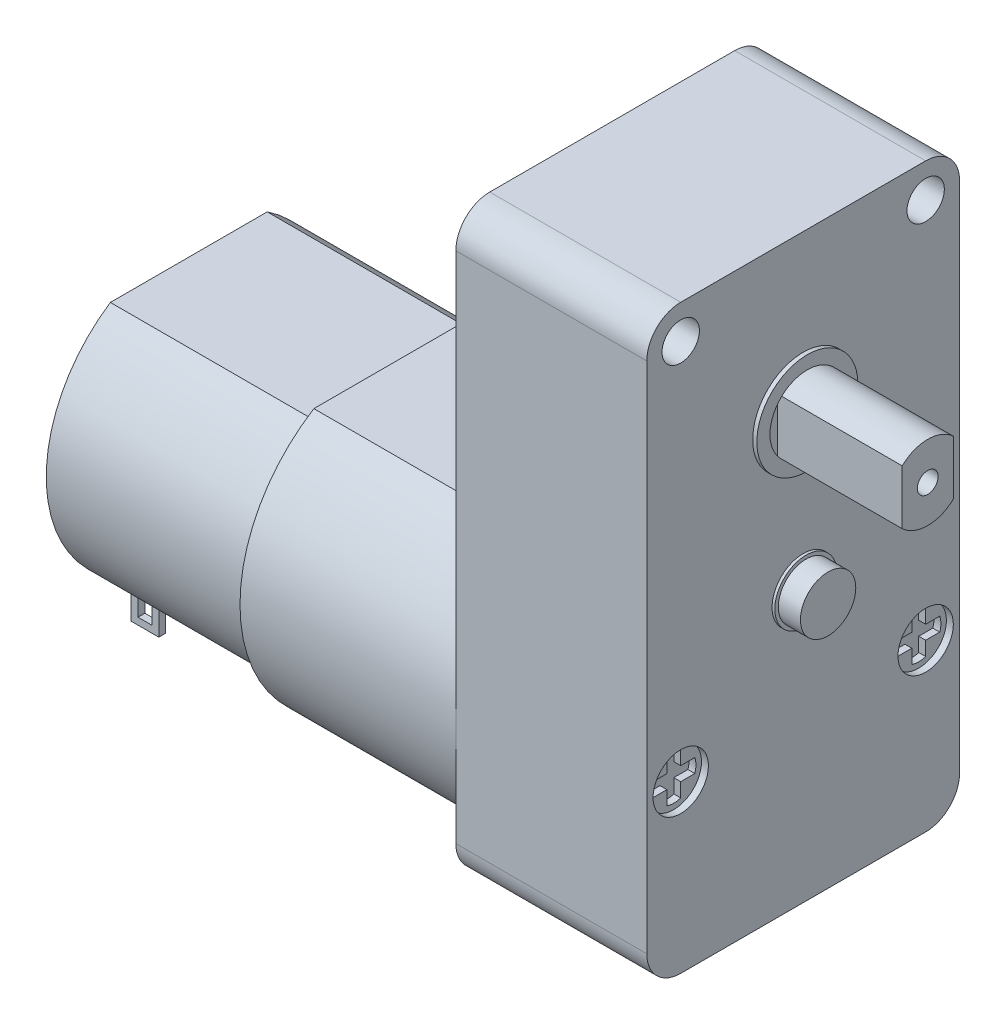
from build123d import *

# Parameters (mm, degrees)
BOSS_EXTRUDE1_DEPTH  = 13.8
SKETCH2_R            = 1.35
CUT_EXTRUDE1_DEPTH   = 13.8
SKETCH3_R            = 2
BOSS_EXTRUDE2_DEPTH  = 1.8
SKETCH4_R            = 2.25
BOSS_EXTRUDE3_DEPTH  = 0.2
SKETCH5_R            = 2.7
BOSS_EXTRUDE4_DEPTH  = 9
SKETCH6_W            = 3.099909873
SKETCH6_H            = 6.147728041
CUT_EXTRUDE2_DEPTH   = 9
SKETCH7_R            = 0.75
CUT_EXTRUDE3_DEPTH   = 2
SKETCH8_R            = 3.65
SKETCH8_R_2          = 2.7
BOSS_EXTRUDE5_DEPTH  = 0.3
SKETCH9_R            = 2
CUT_EXTRUDE4_DEPTH   = 0.5
CUT_EXTRUDE5_DEPTH   = 0.5
BOSS_EXTRUDE6_DEPTH  = 15.6
BOSS_EXTRUDE7_DEPTH  = 15
SKETCH15_R           = 4
BOSS_EXTRUDE8_DEPTH  = 1
SKETCH16_R           = 1
BOSS_EXTRUDE9_DEPTH  = 1
SKETCH17_W           = 2
SKETCH17_H           = 0.5
BOSS_EXTRUDE10_DEPTH = 3
SKETCH18_W           = 1
SKETCH18_H           = 2
CUT_EXTRUDE6_DEPTH   = 13


with BuildPart() as part:
    # Sketch1 → Boss-Extrude1 (new body)
    with BuildSketch(Plane(origin=(0, 0, 0), x_dir=(0, 0, -1), z_dir=(1, 0, 0))):
        with BuildLine():
            Line((2.45, 0), (20.15, 0))
            ThreePointArc((20.15, 0), (21.882411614, 0.717588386), (22.6, 2.45))
            Line((22.6, 2.45), (22.6, 39.55))
            ThreePointArc((22.6, 39.55), (21.882411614, 41.282411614), (20.15, 42))
            Line((20.15, 42), (2.45, 42))
            ThreePointArc((2.45, 42), (0.717588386, 41.282411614), (0, 39.55))
            Line((0, 39.55), (0, 2.45))
            ThreePointArc((0, 2.45), (0.717588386, 0.717588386), (2.45, 0))
        make_face()
    extrude(amount=BOSS_EXTRUDE1_DEPTH)

    # Sketch2 → Cut-Extrude1 (cut)
    with BuildSketch(Plane(origin=(13.8, 0, 0), x_dir=(0, 0, -1), z_dir=(1, 0, 0))):
        with Locations((2.45, 39.55)):
            Circle(SKETCH2_R)
        with Locations((20.15, 39.55)):
            Circle(SKETCH2_R)
    extrude(amount=-CUT_EXTRUDE1_DEPTH, mode=Mode.SUBTRACT)

    # Sketch3 → Boss-Extrude2 (add)
    with BuildSketch(Plane(origin=(13.8, 0, 0), x_dir=(0, 0, -1), z_dir=(1, 0, 0))):
        with Locations((11.3, 19.6)):
            Circle(SKETCH3_R)
    extrude(amount=BOSS_EXTRUDE2_DEPTH)

    # Sketch4 → Boss-Extrude3 (add)
    with BuildSketch(Plane(origin=(13.8, 0, 0), x_dir=(0, 0, -1), z_dir=(1, 0, 0))):
        with Locations((11.3, 19.6)):
            Circle(SKETCH4_R)
    extrude(amount=BOSS_EXTRUDE3_DEPTH)

    # Sketch5 → Boss-Extrude4 (add)
    with BuildSketch(Plane(origin=(13.8, 0, 0), x_dir=(0, 0, -1), z_dir=(1, 0, 0))):
        with Locations((11.3, 30.8)):
            Circle(SKETCH5_R)
    extrude(amount=BOSS_EXTRUDE4_DEPTH)

    # Sketch6 → Cut-Extrude2 (cut)
    with BuildSketch(Plane(origin=(22.8, 0, 0), x_dir=(0, 0, -1), z_dir=(1, 0, 0))):
        with Locations((7.900045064, 31.173864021)):
            Rectangle(SKETCH6_W, SKETCH6_H)
        with Locations((14.699954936, 31.173864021)):
            Rectangle(SKETCH6_W, SKETCH6_H)
    extrude(amount=-CUT_EXTRUDE2_DEPTH, mode=Mode.SUBTRACT)

    # Sketch7 → Cut-Extrude3 (cut)
    with BuildSketch(Plane(origin=(22.8, 0, 0), x_dir=(0, 0, -1), z_dir=(1, 0, 0))):
        with Locations((11.3, 30.8)):
            Circle(SKETCH7_R)
    extrude(amount=-CUT_EXTRUDE3_DEPTH, mode=Mode.SUBTRACT)

    # Sketch8 → Boss-Extrude5 (add)
    with BuildSketch(Plane(origin=(13.8, 0, 0), x_dir=(0, 0, -1), z_dir=(1, 0, 0))):
        with Locations((11.3, 30.8)):
            Circle(SKETCH8_R)
        with Locations((11.3, 30.8)):
            Circle(SKETCH8_R_2, mode=Mode.SUBTRACT)
    extrude(amount=BOSS_EXTRUDE5_DEPTH)

    # Sketch9 → Cut-Extrude4 (cut)
    with BuildSketch(Plane(origin=(13.8, 0, 0), x_dir=(0, 0, -1), z_dir=(1, 0, 0))):
        with Locations((2.45, 12)):
            Circle(SKETCH9_R)
        with Locations((20.15, 12)):
            Circle(SKETCH9_R)
    extrude(amount=-CUT_EXTRUDE4_DEPTH, mode=Mode.SUBTRACT)

    # Sketch10 → Cut-Extrude5 (cut)
    with BuildSketch(Plane(origin=(13.3, 0, 0), x_dir=(0, 0, -1), z_dir=(1, 0, 0))):
        with BuildLine():
            Line((1.95, 13.519868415), (1.95, 12.5))
            Line((1.95, 12.5), (0.930131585, 12.5))
            ThreePointArc((0.930131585, 12.5), (0.85, 12), (0.930131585, 11.5))
            Line((0.930131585, 11.5), (1.95, 11.5))
            Line((1.95, 11.5), (1.95, 10.480131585))
            ThreePointArc((1.95, 10.480131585), (2.45, 10.4), (2.95, 10.480131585))
            Line((2.95, 10.480131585), (2.95, 11.5))
            Line((2.95, 11.5), (3.969868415, 11.5))
            ThreePointArc((3.969868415, 11.5), (4.05, 12), (3.969868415, 12.5))
            Line((3.969868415, 12.5), (2.95, 12.5))
            Line((2.95, 12.5), (2.95, 13.519868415))
            ThreePointArc((2.95, 13.519868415), (2.45, 13.6), (1.95, 13.519868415))
        make_face()
        with BuildLine():
            Line((20.65, 13.519868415), (20.65, 12.5))
            Line((20.65, 12.5), (21.669868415, 12.5))
            ThreePointArc((21.669868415, 12.5), (21.75, 12), (21.669868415, 11.5))
            Line((21.669868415, 11.5), (20.65, 11.5))
            Line((20.65, 11.5), (20.65, 10.480131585))
            ThreePointArc((20.65, 10.480131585), (20.15, 10.4), (19.65, 10.480131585))
            Line((19.65, 10.480131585), (19.65, 11.5))
            Line((19.65, 11.5), (18.630131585, 11.5))
            ThreePointArc((18.630131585, 11.5), (18.55, 12), (18.630131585, 12.5))
            Line((18.630131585, 12.5), (19.65, 12.5))
            Line((19.65, 12.5), (19.65, 13.519868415))
            ThreePointArc((19.65, 13.519868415), (20.15, 13.6), (20.65, 13.519868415))
        make_face()
    extrude(amount=-CUT_EXTRUDE5_DEPTH, mode=Mode.SUBTRACT)

    # Sketch11 → Boss-Extrude6 (add)
    with BuildSketch(Plane.ZY):
        with BuildLine():
            Line((-17.260704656, 0), (-5.339295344, 0))
            ThreePointArc((-5.339295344, 0), (0, 9.6), (-5.339295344, 19.2))
            Line((-5.339295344, 19.2), (-17.260704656, 19.2))
            ThreePointArc((-17.260704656, 19.2), (-22.6, 9.6), (-17.260704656, 0))
        make_face()
    extrude(amount=BOSS_EXTRUDE6_DEPTH)

    # Sketch14 → Boss-Extrude7 (add)
    with BuildSketch(Plane.ZY.offset(15.6)):
        with BuildLine():
            Line((-5.631666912, 18.2), (-16.968333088, 18.2))
            ThreePointArc((-16.968333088, 18.2), (-21.6, 9.6), (-16.968333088, 1))
            Line((-16.968333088, 1), (-5.631666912, 1))
            ThreePointArc((-5.631666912, 1), (-1, 9.6), (-5.631666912, 18.2))
        make_face()
    extrude(amount=BOSS_EXTRUDE7_DEPTH)

    # Sketch15 → Boss-Extrude8 (add)
    with BuildSketch(Plane.ZY.offset(30.6)):
        with Locations((-11.3, 9.6)):
            Circle(SKETCH15_R)
    extrude(amount=BOSS_EXTRUDE8_DEPTH)

    # Sketch16 → Boss-Extrude9 (add)
    with BuildSketch(Plane.ZY.offset(31.6)):
        with Locations((-11.3, 9.6)):
            Circle(SKETCH16_R)
    extrude(amount=BOSS_EXTRUDE9_DEPTH)

    # Sketch17 → Boss-Extrude10 (add)
    with BuildSketch(Plane.XZ.offset(-1)):
        with Locations((-29.1, -6.881666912)):
            Rectangle(SKETCH17_W, SKETCH17_H)
        with Locations((-29.1, -15.718333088)):
            Rectangle(SKETCH17_W, SKETCH17_H)
    extrude(amount=BOSS_EXTRUDE10_DEPTH)

    # Sketch18 → Cut-Extrude6 (cut)
    with BuildSketch(Plane(origin=(0, 0, -15.968333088), x_dir=(-1, 0, 0), z_dir=(0, 0, -1))):
        with Locations((29.1, -0.5)):
            Rectangle(SKETCH18_W, SKETCH18_H)
    extrude(amount=-CUT_EXTRUDE6_DEPTH, mode=Mode.SUBTRACT)


solid = part.part
